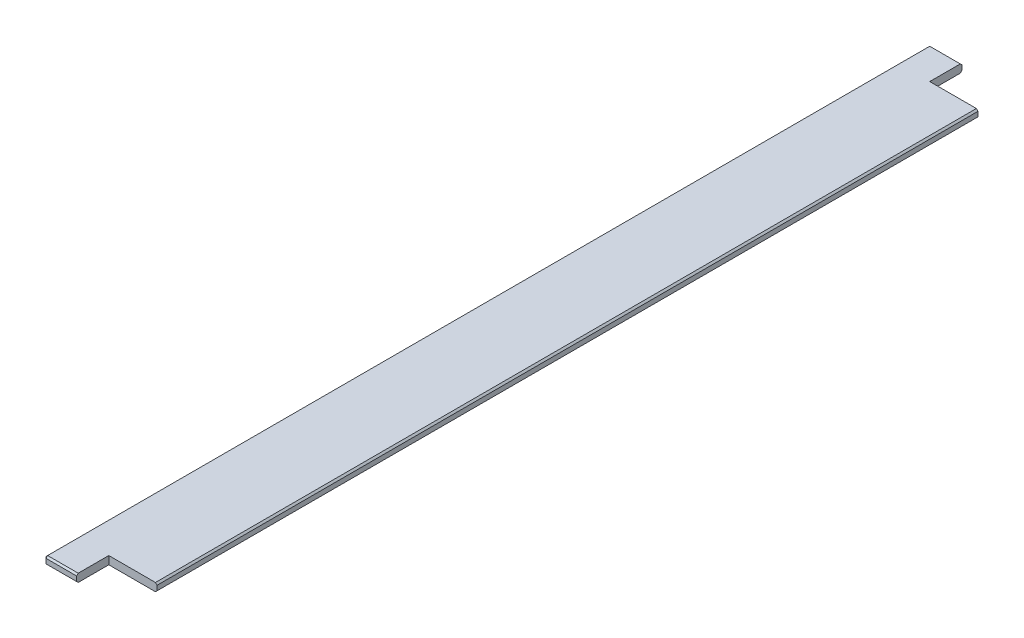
from build123d import *

# Parameters (mm, degrees)
ESQUISSE1_W             = 100
ESQUISSE1_H             = 10
BOSS_EXTRU_1_DEPTH      = 550
CHANFREIN1_SIZE         = 2
ESQUISSE2_W             = 60
ESQUISSE2_H             = 40
ENL_V_MAT_EXTRU_1_DEPTH = 553.358579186


with BuildPart() as part:
    # Esquisse1 → Boss.-Extru.1 (new, symmetric)
    with BuildSketch(Plane.XY):
        Rectangle(ESQUISSE1_W, ESQUISSE1_H)
    extrude(amount=BOSS_EXTRU_1_DEPTH, both=True)

    # Chanfrein1
    chanfrein1_edges = [part.edges().sort_by_distance(p)[0] for p in [
        (-50, 0, 550),
        (0, -5, 550),
        (50, 0, 550),
        (0, -5, -550),
        (-50, 0, -550),
        (0, 5, -550),
        (50, 0, -550),
        (0, 5, 550),
        (50, -5, 0),
        (-50, -5, 0),
        (-50, 5, 0),
        (50, 5, 0),
    ]]
    chamfer(chanfrein1_edges, length=CHANFREIN1_SIZE)

    # Esquisse2 → Enl_v. mat.-Extru.1 (cut, through all)
    with BuildSketch(Plane(origin=(0, 5, 0), x_dir=(1, 0, 0), z_dir=(0, 1, 0))):
        with Locations((20, -530)):
            Rectangle(ESQUISSE2_W, ESQUISSE2_H)
        with Locations((20, 530)):
            Rectangle(ESQUISSE2_W, ESQUISSE2_H)
    extrude(amount=-ENL_V_MAT_EXTRU_1_DEPTH, mode=Mode.SUBTRACT)


solid = part.part
